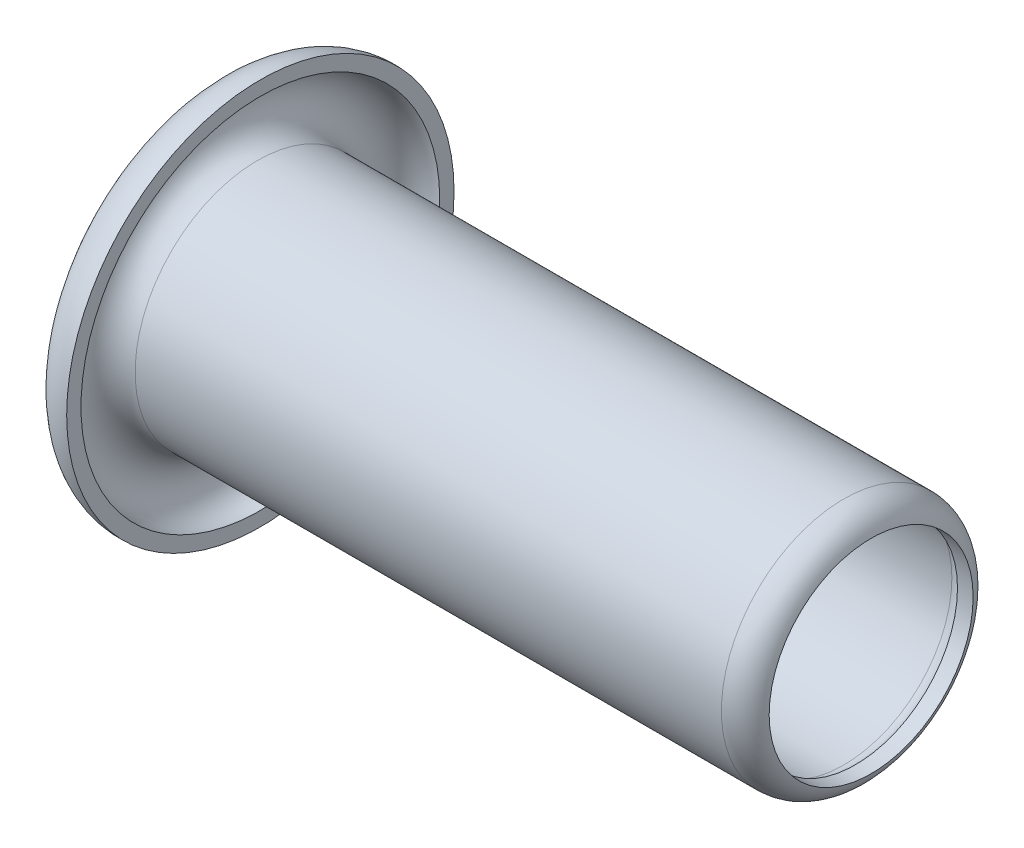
ISO-10303-21;
HEADER;
FILE_DESCRIPTION(('STEP AP214'),'2;1');
FILE_NAME('part.step','',(''),(''),'','','');
FILE_SCHEMA(('AUTOMOTIVE_DESIGN { 1 0 10303 214 1 1 1 1 }'));
ENDSEC;
DATA;
#1=APPLICATION_CONTEXT('core data for automotive mechanical design processes');
#2=APPLICATION_PROTOCOL_DEFINITION('international standard','automotive_design',2000,#1);
#3=PRODUCT_CONTEXT('',#1,'mechanical');
#4=PRODUCT('Part','Part','',(#3));
#5=PRODUCT_RELATED_PRODUCT_CATEGORY('part','',(#4));
#6=PRODUCT_DEFINITION_FORMATION('','',#4);
#7=PRODUCT_DEFINITION_CONTEXT('part definition',#1,'design');
#8=PRODUCT_DEFINITION('design','',#6,#7);
#9=PRODUCT_DEFINITION_SHAPE('','',#8);
#10=(LENGTH_UNIT() NAMED_UNIT(*) SI_UNIT(.MILLI.,.METRE.));
#11=(NAMED_UNIT(*) PLANE_ANGLE_UNIT() SI_UNIT($,.RADIAN.));
#12=(NAMED_UNIT(*) SI_UNIT($,.STERADIAN.) SOLID_ANGLE_UNIT());
#13=UNCERTAINTY_MEASURE_WITH_UNIT(LENGTH_MEASURE(1.E-05),#10,'distance_accuracy_value','');
#14=(GEOMETRIC_REPRESENTATION_CONTEXT(3) GLOBAL_UNCERTAINTY_ASSIGNED_CONTEXT((#13)) GLOBAL_UNIT_ASSIGNED_CONTEXT((#10,
#11,#12)) REPRESENTATION_CONTEXT('',''));
#15=CARTESIAN_POINT('',(0.,0.,0.));
#16=DIRECTION('',(0.,0.,1.));
#17=DIRECTION('',(1.,0.,0.));
#18=AXIS2_PLACEMENT_3D('',#15,#16,#17);
#19=CARTESIAN_POINT('',(15.42,0.,0.));
#20=DIRECTION('',(1.,0.,0.));
#21=DIRECTION('',(0.,0.,-1.));
#22=AXIS2_PLACEMENT_3D('',#19,#20,#21);
#23=TOROIDAL_SURFACE('',#22,2.3,0.35);
#24=CARTESIAN_POINT('',(15.42,0.,0.));
#25=DIRECTION('',(1.,0.,0.));
#26=DIRECTION('',(0.,0.,-1.));
#27=AXIS2_PLACEMENT_3D('',#24,#25,#26);
#28=CIRCLE('',#27,2.65);
#29=CARTESIAN_POINT('',(15.42,0.,-2.65));
#30=VERTEX_POINT('',#29);
#31=EDGE_CURVE('E45',#30,#30,#28,.T.);
#32=ORIENTED_EDGE('',*,*,#31,.F.);
#33=EDGE_LOOP('',(#32));
#34=FACE_BOUND('',#33,.T.);
#35=CARTESIAN_POINT('',(15.7072281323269,0.,0.));
#36=DIRECTION('',(-1.,0.,0.));
#37=DIRECTION('',(0.,0.,1.));
#38=AXIS2_PLACEMENT_3D('',#35,#36,#37);
#39=CIRCLE('',#38,2.5);
#40=CARTESIAN_POINT('',(15.7072281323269,0.,2.5));
#41=VERTEX_POINT('',#40);
#42=EDGE_CURVE('E63',#41,#41,#39,.F.);
#43=ORIENTED_EDGE('',*,*,#42,.T.);
#44=EDGE_LOOP('',(#43));
#45=FACE_BOUND('',#44,.T.);
#46=ADVANCED_FACE('F37',(#34,#45),#23,.F.);
#47=CARTESIAN_POINT('',(15.42,0.,0.));
#48=DIRECTION('',(1.,0.,0.));
#49=DIRECTION('',(0.,0.,-1.));
#50=AXIS2_PLACEMENT_3D('',#47,#48,#49);
#51=TOROIDAL_SURFACE('',#50,2.3,0.7);
#52=CARTESIAN_POINT('',(15.42,0.,0.));
#53=DIRECTION('',(1.,0.,0.));
#54=DIRECTION('',(0.,0.,-1.));
#55=AXIS2_PLACEMENT_3D('',#52,#53,#54);
#56=CIRCLE('',#55,3.);
#57=CARTESIAN_POINT('',(15.42,0.,-3.));
#58=VERTEX_POINT('',#57);
#59=EDGE_CURVE('E49',#58,#58,#56,.T.);
#60=ORIENTED_EDGE('',*,*,#59,.T.);
#61=EDGE_LOOP('',(#60));
#62=FACE_BOUND('',#61,.T.);
#63=CARTESIAN_POINT('',(16.0908203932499,0.,0.));
#64=DIRECTION('',(-1.,0.,0.));
#65=DIRECTION('',(0.,0.,1.));
#66=AXIS2_PLACEMENT_3D('',#63,#64,#65);
#67=CIRCLE('',#66,2.5);
#68=CARTESIAN_POINT('',(16.0908203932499,0.,2.5));
#69=VERTEX_POINT('',#68);
#70=EDGE_CURVE('E41',#69,#69,#67,.T.);
#71=ORIENTED_EDGE('',*,*,#70,.T.);
#72=EDGE_LOOP('',(#71));
#73=FACE_BOUND('',#72,.T.);
#74=ADVANCED_FACE('F70',(#62,#73),#51,.T.);
#75=CARTESIAN_POINT('',(1.05,0.,0.));
#76=DIRECTION('',(1.,0.,0.));
#77=DIRECTION('',(0.,0.,-1.));
#78=AXIS2_PLACEMENT_3D('',#75,#76,#77);
#79=TOROIDAL_SURFACE('',#78,3.7,1.05);
#80=CARTESIAN_POINT('',(1.05,0.,0.));
#81=DIRECTION('',(1.,0.,0.));
#82=DIRECTION('',(0.,0.,-1.));
#83=AXIS2_PLACEMENT_3D('',#80,#81,#82);
#84=CIRCLE('',#83,2.65);
#85=CARTESIAN_POINT('',(1.05,0.,-2.65));
#86=VERTEX_POINT('',#85);
#87=EDGE_CURVE('E10',#86,#86,#84,.T.);
#88=ORIENTED_EDGE('',*,*,#87,.T.);
#89=EDGE_LOOP('',(#88));
#90=FACE_BOUND('',#89,.T.);
#91=CARTESIAN_POINT('',(1.12,0.,0.));
#92=DIRECTION('',(1.,0.,0.));
#93=DIRECTION('',(0.,0.,-1.));
#94=AXIS2_PLACEMENT_3D('',#91,#92,#93);
#95=CIRCLE('',#94,4.7476640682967);
#96=CARTESIAN_POINT('',(1.12,0.,-4.7476640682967));
#97=VERTEX_POINT('',#96);
#98=EDGE_CURVE('E60',#97,#97,#95,.T.);
#99=ORIENTED_EDGE('',*,*,#98,.F.);
#100=EDGE_LOOP('',(#99));
#101=FACE_BOUND('',#100,.T.);
#102=ADVANCED_FACE('F39',(#90,#101),#79,.T.);
#103=CARTESIAN_POINT('',(16.12,0.,0.));
#104=DIRECTION('',(1.,0.,0.));
#105=DIRECTION('',(0.,0.,-1.));
#106=AXIS2_PLACEMENT_3D('',#103,#104,#105);
#107=CYLINDRICAL_SURFACE('',#106,2.65);
#108=ORIENTED_EDGE('',*,*,#31,.T.);
#109=EDGE_LOOP('',(#108));
#110=FACE_BOUND('',#109,.T.);
#111=ORIENTED_EDGE('',*,*,#87,.F.);
#112=EDGE_LOOP('',(#111));
#113=FACE_BOUND('',#112,.T.);
#114=ADVANCED_FACE('F93',(#110,#113),#107,.F.);
#115=CARTESIAN_POINT('',(16.12,0.,0.));
#116=DIRECTION('',(1.,0.,0.));
#117=DIRECTION('',(0.,0.,-1.));
#118=AXIS2_PLACEMENT_3D('',#115,#116,#117);
#119=CYLINDRICAL_SURFACE('',#118,3.);
#120=CARTESIAN_POINT('',(1.05,0.,0.));
#121=DIRECTION('',(1.,0.,0.));
#122=DIRECTION('',(0.,0.,-1.));
#123=AXIS2_PLACEMENT_3D('',#120,#121,#122);
#124=CIRCLE('',#123,3.);
#125=CARTESIAN_POINT('',(1.05,0.,-3.));
#126=VERTEX_POINT('',#125);
#127=EDGE_CURVE('E54',#126,#126,#124,.T.);
#128=ORIENTED_EDGE('',*,*,#127,.T.);
#129=EDGE_LOOP('',(#128));
#130=FACE_BOUND('',#129,.T.);
#131=ORIENTED_EDGE('',*,*,#59,.F.);
#132=EDGE_LOOP('',(#131));
#133=FACE_BOUND('',#132,.T.);
#134=ADVANCED_FACE('F95',(#130,#133),#119,.T.);
#135=CARTESIAN_POINT('',(1.05,0.,0.));
#136=DIRECTION('',(1.,0.,0.));
#137=DIRECTION('',(0.,0.,-1.));
#138=AXIS2_PLACEMENT_3D('',#135,#136,#137);
#139=TOROIDAL_SURFACE('',#138,3.7,0.7);
#140=CARTESIAN_POINT('',(1.12,0.,0.));
#141=DIRECTION('',(1.,0.,0.));
#142=DIRECTION('',(0.,0.,-1.));
#143=AXIS2_PLACEMENT_3D('',#140,#141,#142);
#144=CIRCLE('',#143,4.39649120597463);
#145=CARTESIAN_POINT('',(1.12,0.,-4.39649120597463));
#146=VERTEX_POINT('',#145);
#147=EDGE_CURVE('E57',#146,#146,#144,.T.);
#148=ORIENTED_EDGE('',*,*,#147,.T.);
#149=EDGE_LOOP('',(#148));
#150=FACE_BOUND('',#149,.T.);
#151=ORIENTED_EDGE('',*,*,#127,.F.);
#152=EDGE_LOOP('',(#151));
#153=FACE_BOUND('',#152,.T.);
#154=ADVANCED_FACE('F81',(#150,#153),#139,.F.);
#155=CARTESIAN_POINT('',(1.12,4.39649120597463,0.));
#156=DIRECTION('',(1.,0.,0.));
#157=DIRECTION('',(0.,0.,-1.));
#158=AXIS2_PLACEMENT_3D('',#155,#156,#157);
#159=PLANE('',#158);
#160=ORIENTED_EDGE('',*,*,#98,.T.);
#161=EDGE_LOOP('',(#160));
#162=FACE_BOUND('',#161,.T.);
#163=ORIENTED_EDGE('',*,*,#147,.F.);
#164=EDGE_LOOP('',(#163));
#165=FACE_BOUND('',#164,.T.);
#166=ADVANCED_FACE('F74',(#162,#165),#159,.T.);
#167=CARTESIAN_POINT('',(0.,0.,0.));
#168=DIRECTION('',(-1.,0.,0.));
#169=DIRECTION('',(0.,0.,1.));
#170=AXIS2_PLACEMENT_3D('',#167,#168,#169);
#171=CYLINDRICAL_SURFACE('',#170,2.5);
#172=ORIENTED_EDGE('',*,*,#42,.F.);
#173=EDGE_LOOP('',(#172));
#174=FACE_BOUND('',#173,.T.);
#175=ORIENTED_EDGE('',*,*,#70,.F.);
#176=EDGE_LOOP('',(#175));
#177=FACE_BOUND('',#176,.T.);
#178=ADVANCED_FACE('F72',(#174,#177),#171,.F.);
#179=CLOSED_SHELL('',(#46,#74,#102,#114,#134,#154,#166,#178));
#180=MANIFOLD_SOLID_BREP('B2',#179);
#181=ADVANCED_BREP_SHAPE_REPRESENTATION('',(#18,#180),#14);
#182=SHAPE_DEFINITION_REPRESENTATION(#9,#181);
ENDSEC;
END-ISO-10303-21;
